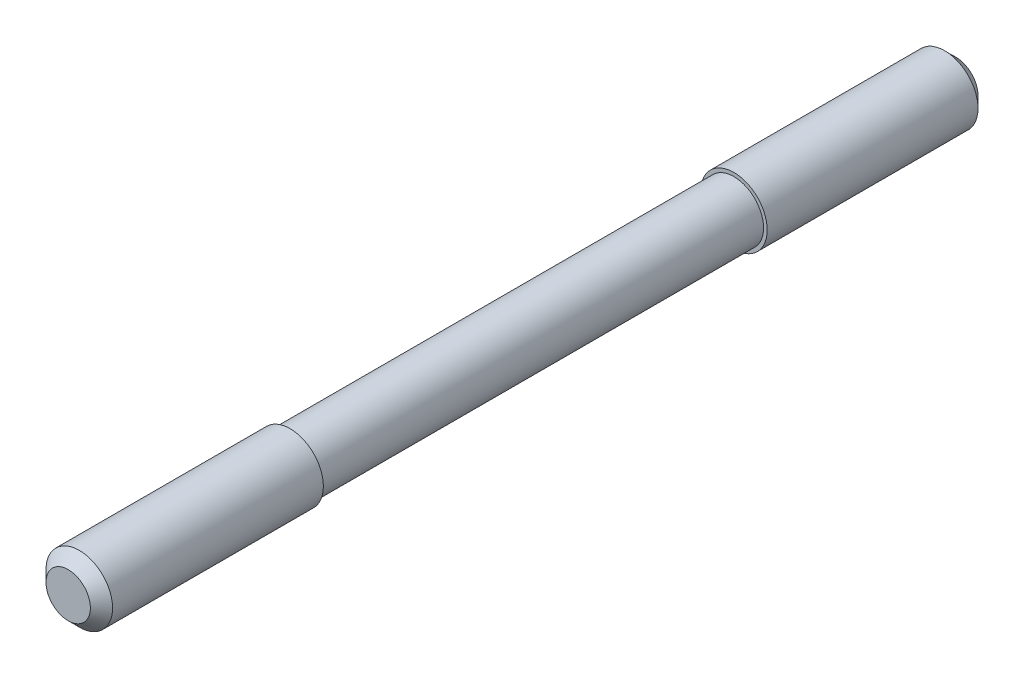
ISO-10303-21;
HEADER;
FILE_DESCRIPTION(('STEP AP214'),'2;1');
FILE_NAME('part.step','',(''),(''),'','','');
FILE_SCHEMA(('AUTOMOTIVE_DESIGN { 1 0 10303 214 1 1 1 1 }'));
ENDSEC;
DATA;
#1=APPLICATION_CONTEXT('core data for automotive mechanical design processes');
#2=APPLICATION_PROTOCOL_DEFINITION('international standard','automotive_design',2000,#1);
#3=PRODUCT_CONTEXT('',#1,'mechanical');
#4=PRODUCT('Part','Part','',(#3));
#5=PRODUCT_RELATED_PRODUCT_CATEGORY('part','',(#4));
#6=PRODUCT_DEFINITION_FORMATION('','',#4);
#7=PRODUCT_DEFINITION_CONTEXT('part definition',#1,'design');
#8=PRODUCT_DEFINITION('design','',#6,#7);
#9=PRODUCT_DEFINITION_SHAPE('','',#8);
#10=(LENGTH_UNIT() NAMED_UNIT(*) SI_UNIT(.MILLI.,.METRE.));
#11=(NAMED_UNIT(*) PLANE_ANGLE_UNIT() SI_UNIT($,.RADIAN.));
#12=(NAMED_UNIT(*) SI_UNIT($,.STERADIAN.) SOLID_ANGLE_UNIT());
#13=UNCERTAINTY_MEASURE_WITH_UNIT(LENGTH_MEASURE(1.E-05),#10,'distance_accuracy_value','');
#14=(GEOMETRIC_REPRESENTATION_CONTEXT(3) GLOBAL_UNCERTAINTY_ASSIGNED_CONTEXT((#13)) GLOBAL_UNIT_ASSIGNED_CONTEXT((#10,
#11,#12)) REPRESENTATION_CONTEXT('',''));
#15=CARTESIAN_POINT('',(0.,0.,0.));
#16=DIRECTION('',(0.,0.,1.));
#17=DIRECTION('',(1.,0.,0.));
#18=AXIS2_PLACEMENT_3D('',#15,#16,#17);
#19=CARTESIAN_POINT('',(0.,0.,0.));
#20=DIRECTION('',(0.,0.,1.));
#21=DIRECTION('',(1.,0.,0.));
#22=AXIS2_PLACEMENT_3D('',#19,#20,#21);
#23=PLANE('',#22);
#24=CARTESIAN_POINT('',(0.,0.,0.));
#25=DIRECTION('',(0.,0.,1.));
#26=DIRECTION('',(1.,0.,0.));
#27=AXIS2_PLACEMENT_3D('',#24,#25,#26);
#28=CIRCLE('',#27,4.);
#29=CARTESIAN_POINT('',(4.,0.,0.));
#30=VERTEX_POINT('',#29);
#31=EDGE_CURVE('E8',#30,#30,#28,.T.);
#32=ORIENTED_EDGE('',*,*,#31,.F.);
#33=EDGE_LOOP('',(#32));
#34=FACE_BOUND('',#33,.T.);
#35=ADVANCED_FACE('F12',(#34),#23,.F.);
#36=CARTESIAN_POINT('',(0.,0.,2.));
#37=DIRECTION('',(0.,0.,1.));
#38=DIRECTION('',(1.,0.,0.));
#39=AXIS2_PLACEMENT_3D('',#36,#37,#38);
#40=CONICAL_SURFACE('',#39,6.,0.785398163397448);
#41=ORIENTED_EDGE('',*,*,#31,.T.);
#42=EDGE_LOOP('',(#41));
#43=FACE_BOUND('',#42,.T.);
#44=CARTESIAN_POINT('',(0.,0.,2.));
#45=DIRECTION('',(0.,0.,1.));
#46=DIRECTION('',(1.,0.,0.));
#47=AXIS2_PLACEMENT_3D('',#44,#45,#46);
#48=CIRCLE('',#47,6.);
#49=CARTESIAN_POINT('',(6.,0.,2.));
#50=VERTEX_POINT('',#49);
#51=EDGE_CURVE('E18',#50,#50,#48,.T.);
#52=ORIENTED_EDGE('',*,*,#51,.F.);
#53=EDGE_LOOP('',(#52));
#54=FACE_BOUND('',#53,.T.);
#55=ADVANCED_FACE('F62',(#43,#54),#40,.T.);
#56=CARTESIAN_POINT('',(0.,0.,70.));
#57=DIRECTION('',(0.,0.,1.));
#58=DIRECTION('',(1.,0.,0.));
#59=AXIS2_PLACEMENT_3D('',#56,#57,#58);
#60=CYLINDRICAL_SURFACE('',#59,6.);
#61=CARTESIAN_POINT('',(0.,0.,40.));
#62=DIRECTION('',(0.,0.,1.));
#63=DIRECTION('',(1.,0.,0.));
#64=AXIS2_PLACEMENT_3D('',#61,#62,#63);
#65=CIRCLE('',#64,6.);
#66=CARTESIAN_POINT('',(6.,0.,40.));
#67=VERTEX_POINT('',#66);
#68=EDGE_CURVE('E22',#67,#67,#65,.T.);
#69=ORIENTED_EDGE('',*,*,#68,.F.);
#70=EDGE_LOOP('',(#69));
#71=FACE_BOUND('',#70,.T.);
#72=ORIENTED_EDGE('',*,*,#51,.T.);
#73=EDGE_LOOP('',(#72));
#74=FACE_BOUND('',#73,.T.);
#75=ADVANCED_FACE('F68',(#71,#74),#60,.T.);
#76=CARTESIAN_POINT('',(6.,0.,40.));
#77=DIRECTION('',(0.,0.,-1.));
#78=DIRECTION('',(-1.,0.,0.));
#79=AXIS2_PLACEMENT_3D('',#76,#77,#78);
#80=PLANE('',#79);
#81=CARTESIAN_POINT('',(0.,0.,40.));
#82=DIRECTION('',(0.,0.,1.));
#83=DIRECTION('',(1.,0.,0.));
#84=AXIS2_PLACEMENT_3D('',#81,#82,#83);
#85=CIRCLE('',#84,5.35);
#86=CARTESIAN_POINT('',(5.35,0.,40.));
#87=VERTEX_POINT('',#86);
#88=EDGE_CURVE('E26',#87,#87,#85,.T.);
#89=ORIENTED_EDGE('',*,*,#88,.F.);
#90=EDGE_LOOP('',(#89));
#91=FACE_BOUND('',#90,.T.);
#92=ORIENTED_EDGE('',*,*,#68,.T.);
#93=EDGE_LOOP('',(#92));
#94=FACE_BOUND('',#93,.T.);
#95=ADVANCED_FACE('F73',(#91,#94),#80,.F.);
#96=CARTESIAN_POINT('',(0.,0.,70.));
#97=DIRECTION('',(0.,0.,1.));
#98=DIRECTION('',(1.,0.,0.));
#99=AXIS2_PLACEMENT_3D('',#96,#97,#98);
#100=CYLINDRICAL_SURFACE('',#99,5.35);
#101=CARTESIAN_POINT('',(0.,0.,120.));
#102=DIRECTION('',(0.,0.,1.));
#103=DIRECTION('',(1.,0.,0.));
#104=AXIS2_PLACEMENT_3D('',#101,#102,#103);
#105=CIRCLE('',#104,5.35);
#106=CARTESIAN_POINT('',(5.35,0.,120.));
#107=VERTEX_POINT('',#106);
#108=EDGE_CURVE('E31',#107,#107,#105,.T.);
#109=ORIENTED_EDGE('',*,*,#108,.F.);
#110=EDGE_LOOP('',(#109));
#111=FACE_BOUND('',#110,.T.);
#112=ORIENTED_EDGE('',*,*,#88,.T.);
#113=EDGE_LOOP('',(#112));
#114=FACE_BOUND('',#113,.T.);
#115=ADVANCED_FACE('F80',(#111,#114),#100,.T.);
#116=CARTESIAN_POINT('',(5.35,0.,120.));
#117=DIRECTION('',(0.,0.,1.));
#118=DIRECTION('',(1.,0.,0.));
#119=AXIS2_PLACEMENT_3D('',#116,#117,#118);
#120=PLANE('',#119);
#121=CARTESIAN_POINT('',(0.,0.,120.));
#122=DIRECTION('',(0.,0.,1.));
#123=DIRECTION('',(1.,0.,0.));
#124=AXIS2_PLACEMENT_3D('',#121,#122,#123);
#125=CIRCLE('',#124,6.);
#126=CARTESIAN_POINT('',(6.,0.,120.));
#127=VERTEX_POINT('',#126);
#128=EDGE_CURVE('E34',#127,#127,#125,.T.);
#129=ORIENTED_EDGE('',*,*,#128,.F.);
#130=EDGE_LOOP('',(#129));
#131=FACE_BOUND('',#130,.T.);
#132=ORIENTED_EDGE('',*,*,#108,.T.);
#133=EDGE_LOOP('',(#132));
#134=FACE_BOUND('',#133,.T.);
#135=ADVANCED_FACE('F58',(#131,#134),#120,.F.);
#136=CARTESIAN_POINT('',(0.,0.,70.));
#137=DIRECTION('',(0.,0.,1.));
#138=DIRECTION('',(1.,0.,0.));
#139=AXIS2_PLACEMENT_3D('',#136,#137,#138);
#140=CYLINDRICAL_SURFACE('',#139,6.);
#141=CARTESIAN_POINT('',(0.,0.,158.));
#142=DIRECTION('',(0.,0.,1.));
#143=DIRECTION('',(1.,0.,0.));
#144=AXIS2_PLACEMENT_3D('',#141,#142,#143);
#145=CIRCLE('',#144,6.);
#146=CARTESIAN_POINT('',(6.,0.,158.));
#147=VERTEX_POINT('',#146);
#148=EDGE_CURVE('E37',#147,#147,#145,.T.);
#149=ORIENTED_EDGE('',*,*,#148,.F.);
#150=EDGE_LOOP('',(#149));
#151=FACE_BOUND('',#150,.T.);
#152=ORIENTED_EDGE('',*,*,#128,.T.);
#153=EDGE_LOOP('',(#152));
#154=FACE_BOUND('',#153,.T.);
#155=ADVANCED_FACE('F48',(#151,#154),#140,.T.);
#156=CARTESIAN_POINT('',(0.,0.,160.));
#157=DIRECTION('',(0.,0.,-1.));
#158=DIRECTION('',(-1.,0.,0.));
#159=AXIS2_PLACEMENT_3D('',#156,#157,#158);
#160=CONICAL_SURFACE('',#159,4.,0.785398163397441);
#161=ORIENTED_EDGE('',*,*,#148,.T.);
#162=EDGE_LOOP('',(#161));
#163=FACE_BOUND('',#162,.T.);
#164=CARTESIAN_POINT('',(0.,0.,160.));
#165=DIRECTION('',(0.,0.,1.));
#166=DIRECTION('',(1.,0.,0.));
#167=AXIS2_PLACEMENT_3D('',#164,#165,#166);
#168=CIRCLE('',#167,4.);
#169=CARTESIAN_POINT('',(4.,0.,160.));
#170=VERTEX_POINT('',#169);
#171=EDGE_CURVE('E40',#170,#170,#168,.T.);
#172=ORIENTED_EDGE('',*,*,#171,.F.);
#173=EDGE_LOOP('',(#172));
#174=FACE_BOUND('',#173,.T.);
#175=ADVANCED_FACE('F46',(#163,#174),#160,.T.);
#176=CARTESIAN_POINT('',(4.,0.,160.));
#177=DIRECTION('',(0.,0.,-1.));
#178=DIRECTION('',(-1.,0.,0.));
#179=AXIS2_PLACEMENT_3D('',#176,#177,#178);
#180=PLANE('',#179);
#181=ORIENTED_EDGE('',*,*,#171,.T.);
#182=EDGE_LOOP('',(#181));
#183=FACE_BOUND('',#182,.T.);
#184=ADVANCED_FACE('F44',(#183),#180,.F.);
#185=CLOSED_SHELL('',(#35,#55,#75,#95,#115,#135,#155,#175,#184));
#186=MANIFOLD_SOLID_BREP('B1',#185);
#187=ADVANCED_BREP_SHAPE_REPRESENTATION('',(#18,#186),#14);
#188=SHAPE_DEFINITION_REPRESENTATION(#9,#187);
ENDSEC;
END-ISO-10303-21;
